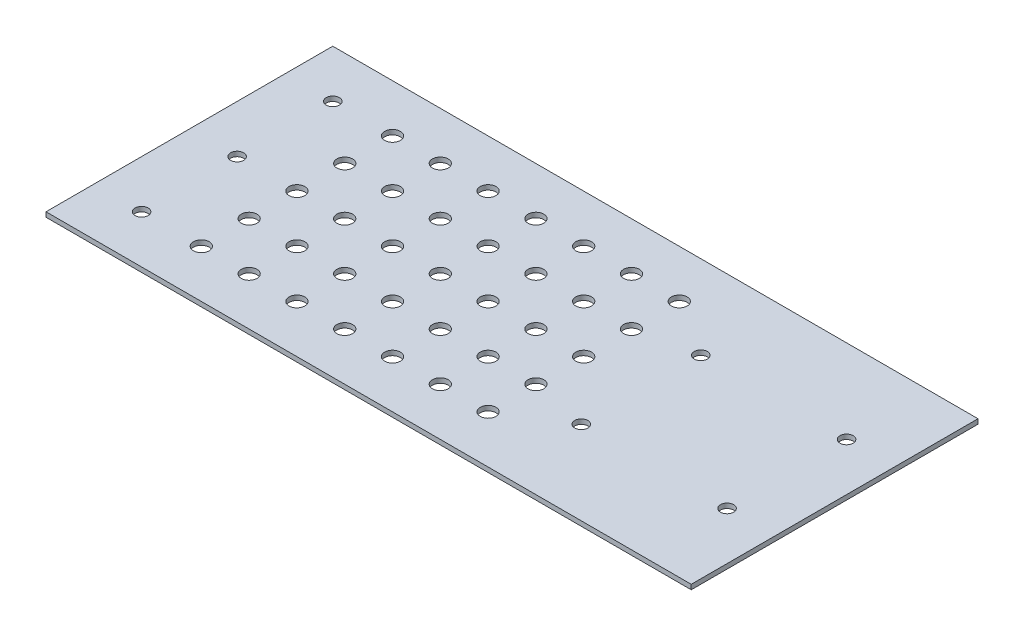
from build123d import *

# Parameters (mm, degrees)
SKETCH1_W           = 270
SKETCH1_H           = 120
BOSS_EXTRUDE1_DEPTH = 2
SKETCH2_R           = 2.75
CUT_EXTRUDE1_DEPTH  = 148.746404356
SKETCH3_R           = 3.3
CUT_EXTRUDE2_DEPTH  = 10
SKETCH4_R           = 2.75
CUT_EXTRUDE3_DEPTH  = 10


with BuildPart() as part:
    # Sketch1 → Boss-Extrude1 (new body)
    with BuildSketch(Plane(origin=(0, 0, 0), x_dir=(1, 0, 0), z_dir=(0, 1, 0))):
        Rectangle(SKETCH1_W, SKETCH1_H)
    extrude(amount=BOSS_EXTRUDE1_DEPTH)

    # Sketch2 → Cut-Extrude1 (cut, through all)
    with BuildSketch(Plane(origin=(0, 2, 0), x_dir=(1, 0, 0), z_dir=(0, 1, 0))):
        with Locations(Location((-115, -40, 0), (0, 0, 270))):
            Circle(SKETCH2_R)
        with Locations(Location((-115, 40, 0), (0, 0, 270))):
            Circle(SKETCH2_R)
        with Locations(Location((-115, 0, 0), (0, 0, 270))):
            Circle(SKETCH2_R)
    extrude(amount=-CUT_EXTRUDE1_DEPTH, mode=Mode.SUBTRACT)

    # Sketch3 → Cut-Extrude2 (cut)
    with BuildSketch(Plane(origin=(0, 2, 0), x_dir=(1, 0, 0), z_dir=(0, 1, 0))):
        with Locations(Location((-90, -40, 0), (0, 0, 270))):
            Circle(SKETCH3_R)
        with Locations(Location((-70, -40, 0), (0, 0, 270))):
            Circle(SKETCH3_R)
        with Locations(Location((-50, -40, 0), (0, 0, 270))):
            Circle(SKETCH3_R)
        with Locations(Location((-30, -40, 0), (0, 0, 270))):
            Circle(SKETCH3_R)
        with Locations(Location((-10, -40, 0), (0, 0, 270))):
            Circle(SKETCH3_R)
        with Locations(Location((10, -40, 0), (0, 0, 270))):
            Circle(SKETCH3_R)
        with Locations(Location((30, -40, 0), (0, 0, 270))):
            Circle(SKETCH3_R)
        with Locations(Location((-70, -20, 0), (0, 0, 270))):
            Circle(SKETCH3_R)
        with Locations(Location((-50, -20, 0), (0, 0, 270))):
            Circle(SKETCH3_R)
        with Locations(Location((-30, -20, 0), (0, 0, 270))):
            Circle(SKETCH3_R)
        with Locations(Location((-10, -20, 0), (0, 0, 270))):
            Circle(SKETCH3_R)
        with Locations(Location((10, -20, 0), (0, 0, 270))):
            Circle(SKETCH3_R)
        with Locations(Location((30, -20, 0), (0, 0, 270))):
            Circle(SKETCH3_R)
        with Locations(Location((-70, 0, 0), (0, 0, 270))):
            Circle(SKETCH3_R)
        with Locations(Location((-50, 0, 0), (0, 0, 270))):
            Circle(SKETCH3_R)
        with Locations(Location((-30, 0, 0), (0, 0, 270))):
            Circle(SKETCH3_R)
        with Locations(Location((-10, 0, 0), (0, 0, 270))):
            Circle(SKETCH3_R)
        with Locations(Location((10, 0, 0), (0, 0, 270))):
            Circle(SKETCH3_R)
        with Locations(Location((30, 0, 0), (0, 0, 270))):
            Circle(SKETCH3_R)
        with Locations(Location((-70, 20, 0), (0, 0, 270))):
            Circle(SKETCH3_R)
        with Locations(Location((-50, 20, 0), (0, 0, 270))):
            Circle(SKETCH3_R)
        with Locations(Location((-30, 20, 0), (0, 0, 270))):
            Circle(SKETCH3_R)
        with Locations(Location((-10, 20, 0), (0, 0, 270))):
            Circle(SKETCH3_R)
        with Locations(Location((10, 20, 0), (0, 0, 270))):
            Circle(SKETCH3_R)
        with Locations(Location((30, 20, 0), (0, 0, 270))):
            Circle(SKETCH3_R)
        with Locations(Location((-70, 40, 0), (0, 0, 270))):
            Circle(SKETCH3_R)
        with Locations(Location((-50, 40, 0), (0, 0, 270))):
            Circle(SKETCH3_R)
        with Locations(Location((-30, 40, 0), (0, 0, 270))):
            Circle(SKETCH3_R)
        with Locations(Location((-10, 40, 0), (0, 0, 270))):
            Circle(SKETCH3_R)
        with Locations(Location((10, 40, 0), (0, 0, 270))):
            Circle(SKETCH3_R)
        with Locations(Location((30, 40, 0), (0, 0, 270))):
            Circle(SKETCH3_R)
        with Locations(Location((-90, -20, 0), (0, 0, 270))):
            Circle(SKETCH3_R)
        with Locations(Location((-90, 0, 0), (0, 0, 270))):
            Circle(SKETCH3_R)
        with Locations(Location((-90, 20, 0), (0, 0, 270))):
            Circle(SKETCH3_R)
        with Locations(Location((-90, 40, 0), (0, 0, 270))):
            Circle(SKETCH3_R)
    extrude(amount=-CUT_EXTRUDE2_DEPTH, mode=Mode.SUBTRACT)

    # Sketch4 → Cut-Extrude3 (cut)
    with BuildSketch(Plane(origin=(0, 2, 0), x_dir=(1, 0, 0), z_dir=(0, 1, 0))):
        with Locations(Location((115, 25, 0), (0, 0, 270))):
            Circle(SKETCH4_R)
        with Locations(Location((115, -25, 0), (0, 0, 270))):
            Circle(SKETCH4_R)
        with Locations(Location((54, 25, 0), (0, 0, 270))):
            Circle(SKETCH4_R)
        with Locations(Location((54, -25, 0), (0, 0, 270))):
            Circle(SKETCH4_R)
    extrude(amount=-CUT_EXTRUDE3_DEPTH, mode=Mode.SUBTRACT)


solid = part.part
